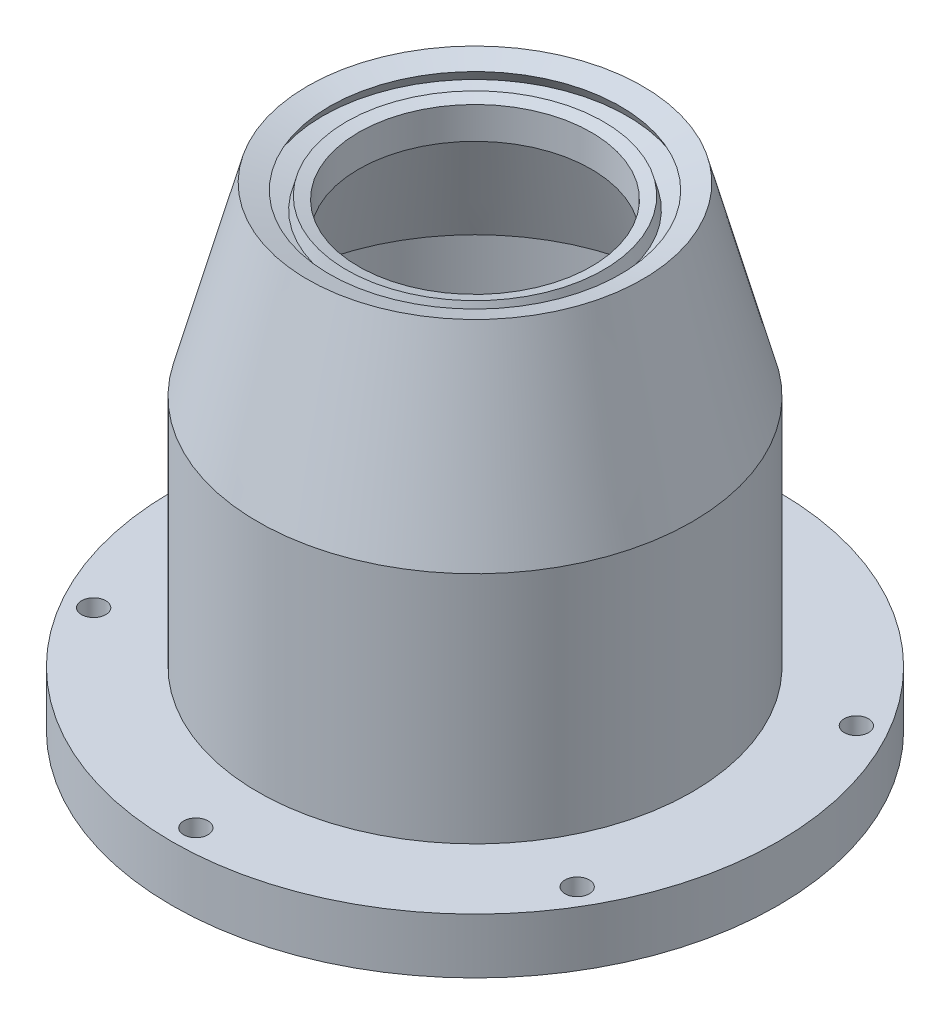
from build123d import *

# Parameters (mm, degrees)
F_10_32_TAPPED_HOLE1_D = 4.826


with BuildPart() as part:
    # Sketch1 → Revolve1 (revolve)
    with BuildSketch(Plane.XY):
        Polygon((-60.325, -190.5), (-60.325, -179.494920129), (-43.210940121, -179.494920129), (-43.210940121, -132.93200332), (-33.3375, -96.083823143), (-28.952254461, -97.387509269), (-30.280203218, -99.687583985), (-26.23200808, -100.772294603), (-25.577033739, -98.327897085), (-23.1521, -98.958670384), (-23.1521, -105.308670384), (-32.522288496, -105.308670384), (-40.035940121, -133.35), (-40.035940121, -190.5), (-44.798440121, -190.5), (-44.798440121, -184.15), (-48.989440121, -184.15), (-48.989440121, -190.5), align=None)
    revolve(axis=Axis((0, 0, 0), (0, -1, 0)))

    # 10-32 Tapped Hole1 (through all)
    with Locations(Plane.XZ.offset(190.5)):
        with Locations((0, 55.5625), (48.118536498, 27.78125), (48.118536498, -27.78125), (0, -55.5625), (-48.118536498, -27.78125), (-48.118536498, 27.78125)):
            Hole(F_10_32_TAPPED_HOLE1_D / 2)


solid = part.part
